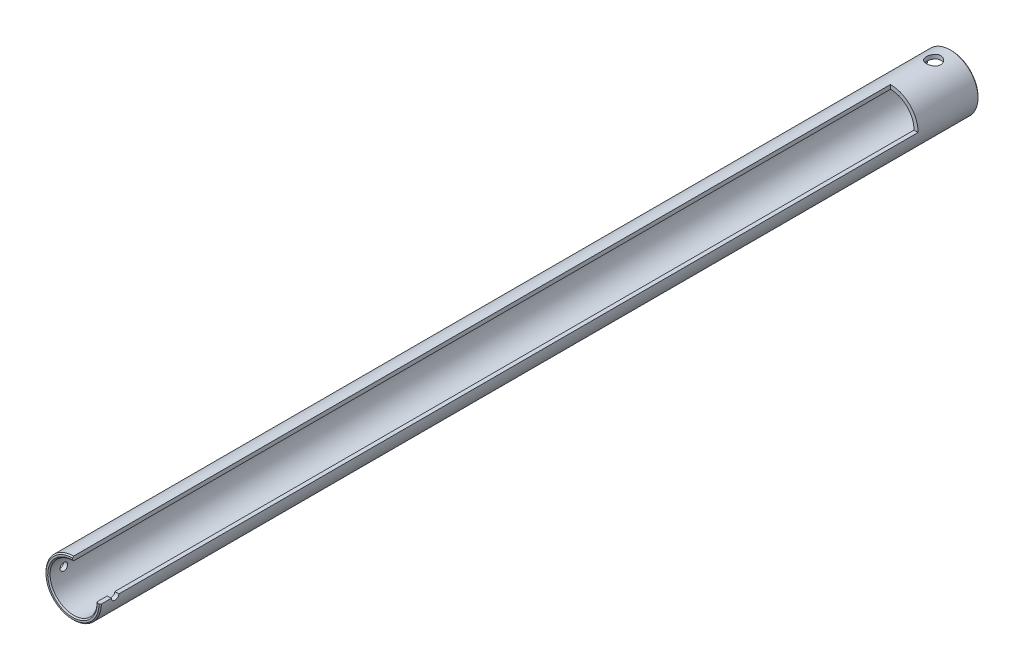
from build123d import *

# Parameters (mm, degrees)
ESQUISSE1_R                  = 17.6
ESQUISSE1_R_2                = 15
BASE_EXTRUSION_DEPTH         = 558.8
ENL_V_MAT_EXTRU_1_DEPTH      = 560.354056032
ENL_V_MAT_EXTRU_1_DEPTH_BACK = 560.354056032
ESQUISSE2_R                  = 2.4
CHANFREIN1_SIZE              = 0.75
ENL_V_MAT_EXTRU_2_DEPTH      = 560.354056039
ENL_V_MAT_EXTRU_2_DEPTH_BACK = 560.354056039
ESQUISSE3_R                  = 4.5
ENL_V_MAT_EXTRU_4_DEPTH      = 520


with BuildPart() as part:
    # Esquisse1 → Base-Extrusion (new body)
    with BuildSketch(Plane.XY):
        Circle(ESQUISSE1_R)
        Circle(ESQUISSE1_R_2, mode=Mode.SUBTRACT)
    extrude(amount=BASE_EXTRUSION_DEPTH)

    # Esquisse2 → Enl_v. mat.-Extru.1 (cut, two sides: drawn at the far end of the back side and taken through both)
    with BuildSketch(Plane(origin=(0, 0, 0), x_dir=(0, 0, -1), z_dir=(1, 0, 0)).offset(-ENL_V_MAT_EXTRU_1_DEPTH_BACK)):
        with Locations(Location((-549.3, 0, 0), (0, 0, 180))):
            Circle(ESQUISSE2_R)
    extrude(amount=ENL_V_MAT_EXTRU_1_DEPTH + ENL_V_MAT_EXTRU_1_DEPTH_BACK, mode=Mode.SUBTRACT)

    # Chanfrein1
    chanfrein1_edges = [part.edges().sort_by_distance(p)[0] for p in [
        (-17.6, 0, 0),
        (-17.6, 0, 558.8),
        (-15, 0, 0),
        (-15, 0, 558.8),
    ]]
    chamfer(chanfrein1_edges, length=CHANFREIN1_SIZE)

    # Esquisse3 → Enl_v. mat.-Extru.2 (cut, two sides: drawn at the far end of the back side and taken through both)
    with BuildSketch(Plane(origin=(0, 0, 0), x_dir=(1, 0, 0), z_dir=(0, 1, 0)).offset(-ENL_V_MAT_EXTRU_2_DEPTH_BACK)):
        with Locations(Location((0, -11.4, 0), (0, 0, 270))):
            Circle(ESQUISSE3_R)
    extrude(amount=ENL_V_MAT_EXTRU_2_DEPTH + ENL_V_MAT_EXTRU_2_DEPTH_BACK, mode=Mode.SUBTRACT)

    # Esquisse5 → Enl_v. mat.-Extru.4 (cut)
    with BuildSketch(Plane.XY.offset(558.8)):
        Polygon((0, 0), (27, 0), (0, 27), align=None)
    extrude(amount=-ENL_V_MAT_EXTRU_4_DEPTH, mode=Mode.SUBTRACT)


solid = part.part
